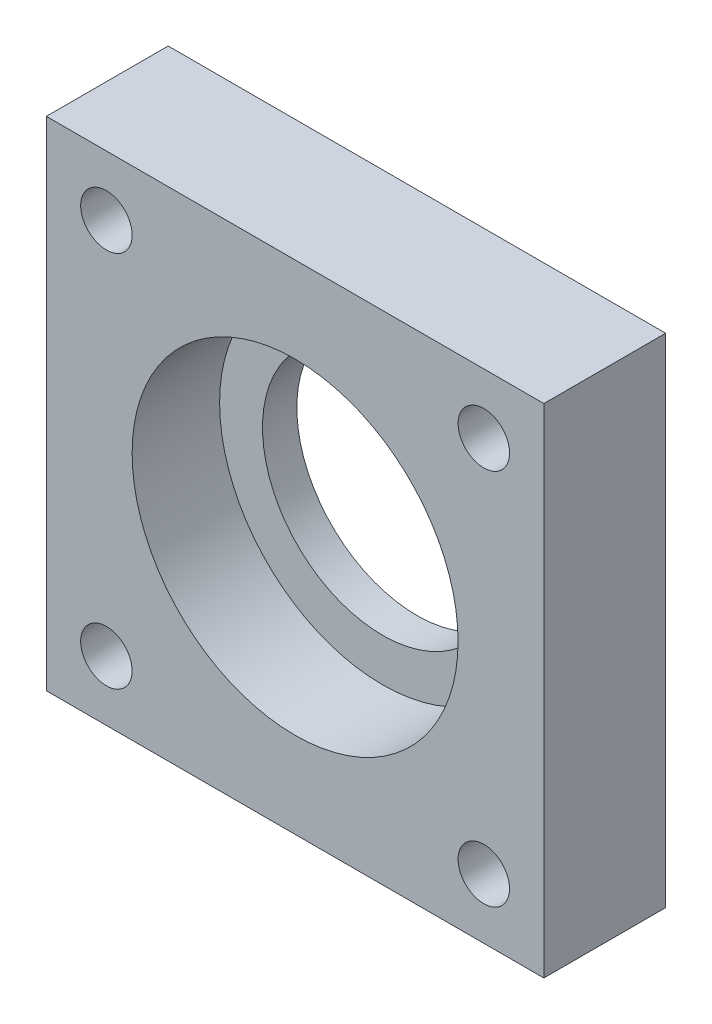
ISO-10303-21;
HEADER;
FILE_DESCRIPTION(('STEP AP214'),'2;1');
FILE_NAME('part.step','',(''),(''),'','','');
FILE_SCHEMA(('AUTOMOTIVE_DESIGN { 1 0 10303 214 1 1 1 1 }'));
ENDSEC;
DATA;
#1=APPLICATION_CONTEXT('core data for automotive mechanical design processes');
#2=APPLICATION_PROTOCOL_DEFINITION('international standard','automotive_design',2000,#1);
#3=PRODUCT_CONTEXT('',#1,'mechanical');
#4=PRODUCT('Part','Part','',(#3));
#5=PRODUCT_RELATED_PRODUCT_CATEGORY('part','',(#4));
#6=PRODUCT_DEFINITION_FORMATION('','',#4);
#7=PRODUCT_DEFINITION_CONTEXT('part definition',#1,'design');
#8=PRODUCT_DEFINITION('design','',#6,#7);
#9=PRODUCT_DEFINITION_SHAPE('','',#8);
#10=(LENGTH_UNIT() NAMED_UNIT(*) SI_UNIT(.MILLI.,.METRE.));
#11=(NAMED_UNIT(*) PLANE_ANGLE_UNIT() SI_UNIT($,.RADIAN.));
#12=(NAMED_UNIT(*) SI_UNIT($,.STERADIAN.) SOLID_ANGLE_UNIT());
#13=UNCERTAINTY_MEASURE_WITH_UNIT(LENGTH_MEASURE(1.E-05),#10,'distance_accuracy_value','');
#14=(GEOMETRIC_REPRESENTATION_CONTEXT(3) GLOBAL_UNCERTAINTY_ASSIGNED_CONTEXT((#13)) GLOBAL_UNIT_ASSIGNED_CONTEXT((#10,
#11,#12)) REPRESENTATION_CONTEXT('',''));
#15=CARTESIAN_POINT('',(0.,0.,0.));
#16=DIRECTION('',(0.,0.,1.));
#17=DIRECTION('',(1.,0.,0.));
#18=AXIS2_PLACEMENT_3D('',#15,#16,#17);
#19=CARTESIAN_POINT('',(6.87683823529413,0.,5.1));
#20=DIRECTION('',(1.,0.,0.));
#21=DIRECTION('',(0.,1.,0.));
#22=AXIS2_PLACEMENT_3D('',#19,#20,#21);
#23=PLANE('',#22);
#24=DIRECTION('',(0.,0.,-1.));
#25=VECTOR('',#24,1.);
#26=CARTESIAN_POINT('',(6.87683823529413,-19.7242647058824,5.1));
#27=LINE('',#26,#25);
#28=CARTESIAN_POINT('',(6.87683823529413,-19.7242647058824,5.1));
#29=VERTEX_POINT('',#28);
#30=CARTESIAN_POINT('',(6.87683823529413,-19.7242647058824,-2.));
#31=VERTEX_POINT('',#30);
#32=EDGE_CURVE('E92',#29,#31,#27,.T.);
#33=ORIENTED_EDGE('',*,*,#32,.T.);
#34=DIRECTION('',(0.,-1.,0.));
#35=VECTOR('',#34,1.);
#36=CARTESIAN_POINT('',(6.87683823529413,0.,-2.));
#37=LINE('',#36,#35);
#38=CARTESIAN_POINT('',(6.87683823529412,9.27573529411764,-2.));
#39=VERTEX_POINT('',#38);
#40=EDGE_CURVE('E87',#39,#31,#37,.T.);
#41=ORIENTED_EDGE('',*,*,#40,.F.);
#42=DIRECTION('',(0.,0.,-1.));
#43=VECTOR('',#42,1.);
#44=CARTESIAN_POINT('',(6.87683823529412,9.27573529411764,5.1));
#45=LINE('',#44,#43);
#46=CARTESIAN_POINT('',(6.87683823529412,9.27573529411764,5.1));
#47=VERTEX_POINT('',#46);
#48=EDGE_CURVE('E11',#47,#39,#45,.T.);
#49=ORIENTED_EDGE('',*,*,#48,.F.);
#50=DIRECTION('',(0.,-1.,0.));
#51=VECTOR('',#50,1.);
#52=CARTESIAN_POINT('',(6.87683823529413,0.,5.1));
#53=LINE('',#52,#51);
#54=EDGE_CURVE('E111',#47,#29,#53,.T.);
#55=ORIENTED_EDGE('',*,*,#54,.T.);
#56=EDGE_LOOP('',(#33,#41,#49,#55));
#57=FACE_BOUND('',#56,.T.);
#58=ADVANCED_FACE('F35',(#57),#23,.T.);
#59=CARTESIAN_POINT('',(0.,9.27573529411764,5.1));
#60=DIRECTION('',(0.,1.,0.));
#61=DIRECTION('',(0.,0.,1.));
#62=AXIS2_PLACEMENT_3D('',#59,#60,#61);
#63=PLANE('',#62);
#64=ORIENTED_EDGE('',*,*,#48,.T.);
#65=DIRECTION('',(1.,0.,0.));
#66=VECTOR('',#65,1.);
#67=CARTESIAN_POINT('',(0.,9.27573529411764,-2.));
#68=LINE('',#67,#66);
#69=CARTESIAN_POINT('',(-22.1231617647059,9.27573529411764,-2.));
#70=VERTEX_POINT('',#69);
#71=EDGE_CURVE('E75',#70,#39,#68,.T.);
#72=ORIENTED_EDGE('',*,*,#71,.F.);
#73=DIRECTION('',(0.,0.,-1.));
#74=VECTOR('',#73,1.);
#75=CARTESIAN_POINT('',(-22.1231617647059,9.27573529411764,5.1));
#76=LINE('',#75,#74);
#77=CARTESIAN_POINT('',(-22.1231617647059,9.27573529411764,5.1));
#78=VERTEX_POINT('',#77);
#79=EDGE_CURVE('E43',#78,#70,#76,.T.);
#80=ORIENTED_EDGE('',*,*,#79,.F.);
#81=DIRECTION('',(1.,0.,0.));
#82=VECTOR('',#81,1.);
#83=CARTESIAN_POINT('',(0.,9.27573529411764,5.1));
#84=LINE('',#83,#82);
#85=EDGE_CURVE('E78',#78,#47,#84,.T.);
#86=ORIENTED_EDGE('',*,*,#85,.T.);
#87=EDGE_LOOP('',(#64,#72,#80,#86));
#88=FACE_BOUND('',#87,.T.);
#89=ADVANCED_FACE('F74',(#88),#63,.T.);
#90=CARTESIAN_POINT('',(-22.1231617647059,0.,5.1));
#91=DIRECTION('',(1.,0.,0.));
#92=DIRECTION('',(0.,1.,0.));
#93=AXIS2_PLACEMENT_3D('',#90,#91,#92);
#94=PLANE('',#93);
#95=ORIENTED_EDGE('',*,*,#79,.T.);
#96=DIRECTION('',(0.,-1.,0.));
#97=VECTOR('',#96,1.);
#98=CARTESIAN_POINT('',(-22.1231617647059,0.,-2.));
#99=LINE('',#98,#97);
#100=CARTESIAN_POINT('',(-22.1231617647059,-19.7242647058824,-2.));
#101=VERTEX_POINT('',#100);
#102=EDGE_CURVE('E90',#70,#101,#99,.T.);
#103=ORIENTED_EDGE('',*,*,#102,.T.);
#104=DIRECTION('',(0.,0.,-1.));
#105=VECTOR('',#104,1.);
#106=CARTESIAN_POINT('',(-22.1231617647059,-19.7242647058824,5.1));
#107=LINE('',#106,#105);
#108=CARTESIAN_POINT('',(-22.1231617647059,-19.7242647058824,5.1));
#109=VERTEX_POINT('',#108);
#110=EDGE_CURVE('E120',#109,#101,#107,.T.);
#111=ORIENTED_EDGE('',*,*,#110,.F.);
#112=DIRECTION('',(0.,-1.,0.));
#113=VECTOR('',#112,1.);
#114=CARTESIAN_POINT('',(-22.1231617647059,0.,5.1));
#115=LINE('',#114,#113);
#116=EDGE_CURVE('E114',#78,#109,#115,.T.);
#117=ORIENTED_EDGE('',*,*,#116,.F.);
#118=EDGE_LOOP('',(#95,#103,#111,#117));
#119=FACE_BOUND('',#118,.T.);
#120=ADVANCED_FACE('F123',(#119),#94,.F.);
#121=CARTESIAN_POINT('',(-7.62316176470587,-5.22426470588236,5.1));
#122=DIRECTION('',(0.,0.,-1.));
#123=DIRECTION('',(-1.,0.,0.));
#124=AXIS2_PLACEMENT_3D('',#121,#122,#123);
#125=CYLINDRICAL_SURFACE('',#124,9.5);
#126=CARTESIAN_POINT('',(-7.62316176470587,-5.22426470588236,5.1));
#127=DIRECTION('',(0.,0.,1.));
#128=DIRECTION('',(1.,0.,0.));
#129=AXIS2_PLACEMENT_3D('',#126,#127,#128);
#130=CIRCLE('',#129,9.5);
#131=CARTESIAN_POINT('',(1.87683823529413,-5.22426470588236,5.1));
#132=VERTEX_POINT('',#131);
#133=EDGE_CURVE('E108',#132,#132,#130,.T.);
#134=ORIENTED_EDGE('',*,*,#133,.T.);
#135=EDGE_LOOP('',(#134));
#136=FACE_BOUND('',#135,.T.);
#137=CARTESIAN_POINT('',(-7.62316176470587,-5.22426470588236,0.));
#138=DIRECTION('',(0.,0.,1.));
#139=DIRECTION('',(1.,0.,0.));
#140=AXIS2_PLACEMENT_3D('',#137,#138,#139);
#141=CIRCLE('',#140,9.5);
#142=CARTESIAN_POINT('',(1.87683823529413,-5.22426470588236,0.));
#143=VERTEX_POINT('',#142);
#144=EDGE_CURVE('E106',#143,#143,#141,.T.);
#145=ORIENTED_EDGE('',*,*,#144,.F.);
#146=EDGE_LOOP('',(#145));
#147=FACE_BOUND('',#146,.T.);
#148=ADVANCED_FACE('F37',(#136,#147),#125,.F.);
#149=CARTESIAN_POINT('',(0.,-19.7242647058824,5.1));
#150=DIRECTION('',(0.,1.,0.));
#151=DIRECTION('',(0.,0.,1.));
#152=AXIS2_PLACEMENT_3D('',#149,#150,#151);
#153=PLANE('',#152);
#154=ORIENTED_EDGE('',*,*,#110,.T.);
#155=DIRECTION('',(1.,0.,0.));
#156=VECTOR('',#155,1.);
#157=CARTESIAN_POINT('',(0.,-19.7242647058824,-2.));
#158=LINE('',#157,#156);
#159=EDGE_CURVE('E102',#101,#31,#158,.T.);
#160=ORIENTED_EDGE('',*,*,#159,.T.);
#161=ORIENTED_EDGE('',*,*,#32,.F.);
#162=DIRECTION('',(1.,0.,0.));
#163=VECTOR('',#162,1.);
#164=CARTESIAN_POINT('',(0.,-19.7242647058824,5.1));
#165=LINE('',#164,#163);
#166=EDGE_CURVE('E50',#109,#29,#165,.T.);
#167=ORIENTED_EDGE('',*,*,#166,.F.);
#168=EDGE_LOOP('',(#154,#160,#161,#167));
#169=FACE_BOUND('',#168,.T.);
#170=ADVANCED_FACE('F128',(#169),#153,.F.);
#171=CARTESIAN_POINT('',(0.,0.,5.1));
#172=DIRECTION('',(0.,0.,1.));
#173=DIRECTION('',(1.,0.,0.));
#174=AXIS2_PLACEMENT_3D('',#171,#172,#173);
#175=PLANE('',#174);
#176=CARTESIAN_POINT('',(-18.6231617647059,-16.2242647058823,5.1));
#177=DIRECTION('',(0.,0.,1.));
#178=DIRECTION('',(1.,0.,0.));
#179=AXIS2_PLACEMENT_3D('',#176,#177,#178);
#180=CIRCLE('',#179,1.5);
#181=CARTESIAN_POINT('',(-17.1231617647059,-16.2242647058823,5.1));
#182=VERTEX_POINT('',#181);
#183=EDGE_CURVE('E247',#182,#182,#180,.T.);
#184=ORIENTED_EDGE('',*,*,#183,.F.);
#185=EDGE_LOOP('',(#184));
#186=FACE_BOUND('',#185,.T.);
#187=CARTESIAN_POINT('',(3.37683823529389,-16.2242647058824,5.1));
#188=DIRECTION('',(0.,0.,1.));
#189=DIRECTION('',(1.,0.,0.));
#190=AXIS2_PLACEMENT_3D('',#187,#188,#189);
#191=CIRCLE('',#190,1.5);
#192=CARTESIAN_POINT('',(4.87683823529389,-16.2242647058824,5.1));
#193=VERTEX_POINT('',#192);
#194=EDGE_CURVE('E249',#193,#193,#191,.T.);
#195=ORIENTED_EDGE('',*,*,#194,.F.);
#196=EDGE_LOOP('',(#195));
#197=FACE_BOUND('',#196,.T.);
#198=CARTESIAN_POINT('',(3.376838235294,5.77573529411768,5.1));
#199=DIRECTION('',(0.,0.,1.));
#200=DIRECTION('',(1.,0.,0.));
#201=AXIS2_PLACEMENT_3D('',#198,#199,#200);
#202=CIRCLE('',#201,1.5);
#203=CARTESIAN_POINT('',(4.876838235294,5.77573529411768,5.1));
#204=VERTEX_POINT('',#203);
#205=EDGE_CURVE('E261',#204,#204,#202,.T.);
#206=ORIENTED_EDGE('',*,*,#205,.F.);
#207=EDGE_LOOP('',(#206));
#208=FACE_BOUND('',#207,.T.);
#209=CARTESIAN_POINT('',(-18.6231617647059,5.77573529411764,5.1));
#210=DIRECTION('',(0.,0.,1.));
#211=DIRECTION('',(1.,0.,0.));
#212=AXIS2_PLACEMENT_3D('',#209,#210,#211);
#213=CIRCLE('',#212,1.5);
#214=CARTESIAN_POINT('',(-17.1231617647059,5.77573529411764,5.1));
#215=VERTEX_POINT('',#214);
#216=EDGE_CURVE('E254',#215,#215,#213,.T.);
#217=ORIENTED_EDGE('',*,*,#216,.F.);
#218=EDGE_LOOP('',(#217));
#219=FACE_BOUND('',#218,.T.);
#220=ORIENTED_EDGE('',*,*,#133,.F.);
#221=EDGE_LOOP('',(#220));
#222=FACE_BOUND('',#221,.T.);
#223=ORIENTED_EDGE('',*,*,#54,.F.);
#224=ORIENTED_EDGE('',*,*,#85,.F.);
#225=ORIENTED_EDGE('',*,*,#116,.T.);
#226=ORIENTED_EDGE('',*,*,#166,.T.);
#227=EDGE_LOOP('',(#223,#224,#225,#226));
#228=FACE_BOUND('',#227,.T.);
#229=ADVANCED_FACE('F125',(#186,#197,#208,#219,#222,#228),#175,.T.);
#230=CARTESIAN_POINT('',(0.,0.,0.));
#231=DIRECTION('',(0.,0.,1.));
#232=DIRECTION('',(1.,0.,0.));
#233=AXIS2_PLACEMENT_3D('',#230,#231,#232);
#234=PLANE('',#233);
#235=CARTESIAN_POINT('',(-7.62316176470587,-5.22426470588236,0.));
#236=DIRECTION('',(0.,0.,1.));
#237=DIRECTION('',(1.,0.,0.));
#238=AXIS2_PLACEMENT_3D('',#235,#236,#237);
#239=CIRCLE('',#238,7.);
#240=CARTESIAN_POINT('',(-0.623161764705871,-5.22426470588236,0.));
#241=VERTEX_POINT('',#240);
#242=EDGE_CURVE('E93',#241,#241,#239,.T.);
#243=ORIENTED_EDGE('',*,*,#242,.F.);
#244=EDGE_LOOP('',(#243));
#245=FACE_BOUND('',#244,.T.);
#246=ORIENTED_EDGE('',*,*,#144,.T.);
#247=EDGE_LOOP('',(#246));
#248=FACE_BOUND('',#247,.T.);
#249=ADVANCED_FACE('F127',(#245,#248),#234,.T.);
#250=CARTESIAN_POINT('',(-7.62316176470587,-5.22426470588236,-2.));
#251=DIRECTION('',(0.,0.,1.));
#252=DIRECTION('',(1.,0.,0.));
#253=AXIS2_PLACEMENT_3D('',#250,#251,#252);
#254=CYLINDRICAL_SURFACE('',#253,7.);
#255=CARTESIAN_POINT('',(-7.62316176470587,-5.22426470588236,-2.));
#256=DIRECTION('',(0.,0.,1.));
#257=DIRECTION('',(1.,0.,0.));
#258=AXIS2_PLACEMENT_3D('',#255,#256,#257);
#259=CIRCLE('',#258,7.);
#260=CARTESIAN_POINT('',(-0.623161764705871,-5.22426470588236,-2.));
#261=VERTEX_POINT('',#260);
#262=EDGE_CURVE('E104',#261,#261,#259,.T.);
#263=ORIENTED_EDGE('',*,*,#262,.F.);
#264=EDGE_LOOP('',(#263));
#265=FACE_BOUND('',#264,.T.);
#266=ORIENTED_EDGE('',*,*,#242,.T.);
#267=EDGE_LOOP('',(#266));
#268=FACE_BOUND('',#267,.T.);
#269=ADVANCED_FACE('F135',(#265,#268),#254,.F.);
#270=CARTESIAN_POINT('',(0.,0.,-2.));
#271=DIRECTION('',(0.,0.,1.));
#272=DIRECTION('',(1.,0.,0.));
#273=AXIS2_PLACEMENT_3D('',#270,#271,#272);
#274=PLANE('',#273);
#275=CARTESIAN_POINT('',(-18.6231617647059,-16.2242647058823,-2.));
#276=DIRECTION('',(0.,0.,1.));
#277=DIRECTION('',(1.,0.,0.));
#278=AXIS2_PLACEMENT_3D('',#275,#276,#277);
#279=CIRCLE('',#278,1.5);
#280=CARTESIAN_POINT('',(-17.1231617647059,-16.2242647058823,-2.));
#281=VERTEX_POINT('',#280);
#282=EDGE_CURVE('E245',#281,#281,#279,.F.);
#283=ORIENTED_EDGE('',*,*,#282,.F.);
#284=EDGE_LOOP('',(#283));
#285=FACE_BOUND('',#284,.T.);
#286=CARTESIAN_POINT('',(3.37683823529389,-16.2242647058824,-2.));
#287=DIRECTION('',(0.,0.,1.));
#288=DIRECTION('',(1.,0.,0.));
#289=AXIS2_PLACEMENT_3D('',#286,#287,#288);
#290=CIRCLE('',#289,1.5);
#291=CARTESIAN_POINT('',(4.87683823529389,-16.2242647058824,-2.));
#292=VERTEX_POINT('',#291);
#293=EDGE_CURVE('E252',#292,#292,#290,.F.);
#294=ORIENTED_EDGE('',*,*,#293,.F.);
#295=EDGE_LOOP('',(#294));
#296=FACE_BOUND('',#295,.T.);
#297=CARTESIAN_POINT('',(3.376838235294,5.77573529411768,-2.));
#298=DIRECTION('',(0.,0.,1.));
#299=DIRECTION('',(1.,0.,0.));
#300=AXIS2_PLACEMENT_3D('',#297,#298,#299);
#301=CIRCLE('',#300,1.5);
#302=CARTESIAN_POINT('',(4.876838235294,5.77573529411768,-2.));
#303=VERTEX_POINT('',#302);
#304=EDGE_CURVE('E256',#303,#303,#301,.F.);
#305=ORIENTED_EDGE('',*,*,#304,.F.);
#306=EDGE_LOOP('',(#305));
#307=FACE_BOUND('',#306,.T.);
#308=CARTESIAN_POINT('',(-18.6231617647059,5.77573529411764,-2.));
#309=DIRECTION('',(0.,0.,1.));
#310=DIRECTION('',(1.,0.,0.));
#311=AXIS2_PLACEMENT_3D('',#308,#309,#310);
#312=CIRCLE('',#311,1.5);
#313=CARTESIAN_POINT('',(-17.1231617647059,5.77573529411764,-2.));
#314=VERTEX_POINT('',#313);
#315=EDGE_CURVE('E96',#314,#314,#312,.F.);
#316=ORIENTED_EDGE('',*,*,#315,.F.);
#317=EDGE_LOOP('',(#316));
#318=FACE_BOUND('',#317,.T.);
#319=ORIENTED_EDGE('',*,*,#40,.T.);
#320=ORIENTED_EDGE('',*,*,#159,.F.);
#321=ORIENTED_EDGE('',*,*,#102,.F.);
#322=ORIENTED_EDGE('',*,*,#71,.T.);
#323=EDGE_LOOP('',(#319,#320,#321,#322));
#324=FACE_BOUND('',#323,.T.);
#325=ORIENTED_EDGE('',*,*,#262,.T.);
#326=EDGE_LOOP('',(#325));
#327=FACE_BOUND('',#326,.T.);
#328=ADVANCED_FACE('F84',(#285,#296,#307,#318,#324,#327),#274,.F.);
#329=CARTESIAN_POINT('',(-18.6231617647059,5.77573529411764,-6.24264068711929));
#330=DIRECTION('',(0.,0.,1.));
#331=DIRECTION('',(1.,0.,0.));
#332=AXIS2_PLACEMENT_3D('',#329,#330,#331);
#333=CYLINDRICAL_SURFACE('',#332,1.5);
#334=ORIENTED_EDGE('',*,*,#315,.T.);
#335=EDGE_LOOP('',(#334));
#336=FACE_BOUND('',#335,.T.);
#337=ORIENTED_EDGE('',*,*,#216,.T.);
#338=EDGE_LOOP('',(#337));
#339=FACE_BOUND('',#338,.T.);
#340=ADVANCED_FACE('F198',(#336,#339),#333,.F.);
#341=CARTESIAN_POINT('',(3.376838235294,5.77573529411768,-6.24264068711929));
#342=DIRECTION('',(0.,0.,1.));
#343=DIRECTION('',(1.,0.,0.));
#344=AXIS2_PLACEMENT_3D('',#341,#342,#343);
#345=CYLINDRICAL_SURFACE('',#344,1.5);
#346=ORIENTED_EDGE('',*,*,#304,.T.);
#347=EDGE_LOOP('',(#346));
#348=FACE_BOUND('',#347,.T.);
#349=ORIENTED_EDGE('',*,*,#205,.T.);
#350=EDGE_LOOP('',(#349));
#351=FACE_BOUND('',#350,.T.);
#352=ADVANCED_FACE('F208',(#348,#351),#345,.F.);
#353=CARTESIAN_POINT('',(3.37683823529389,-16.2242647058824,-6.24264068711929));
#354=DIRECTION('',(0.,0.,1.));
#355=DIRECTION('',(1.,0.,0.));
#356=AXIS2_PLACEMENT_3D('',#353,#354,#355);
#357=CYLINDRICAL_SURFACE('',#356,1.5);
#358=ORIENTED_EDGE('',*,*,#293,.T.);
#359=EDGE_LOOP('',(#358));
#360=FACE_BOUND('',#359,.T.);
#361=ORIENTED_EDGE('',*,*,#194,.T.);
#362=EDGE_LOOP('',(#361));
#363=FACE_BOUND('',#362,.T.);
#364=ADVANCED_FACE('F218',(#360,#363),#357,.F.);
#365=CARTESIAN_POINT('',(-18.6231617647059,-16.2242647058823,-6.24264068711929));
#366=DIRECTION('',(0.,0.,1.));
#367=DIRECTION('',(1.,0.,0.));
#368=AXIS2_PLACEMENT_3D('',#365,#366,#367);
#369=CYLINDRICAL_SURFACE('',#368,1.5);
#370=ORIENTED_EDGE('',*,*,#282,.T.);
#371=EDGE_LOOP('',(#370));
#372=FACE_BOUND('',#371,.T.);
#373=ORIENTED_EDGE('',*,*,#183,.T.);
#374=EDGE_LOOP('',(#373));
#375=FACE_BOUND('',#374,.T.);
#376=ADVANCED_FACE('F228',(#372,#375),#369,.F.);
#377=CLOSED_SHELL('',(#58,#89,#120,#148,#170,#229,#249,#269,#328,#340,#352,#364,#376));
#378=MANIFOLD_SOLID_BREP('B2',#377);
#379=ADVANCED_BREP_SHAPE_REPRESENTATION('',(#18,#378),#14);
#380=SHAPE_DEFINITION_REPRESENTATION(#9,#379);
ENDSEC;
END-ISO-10303-21;
